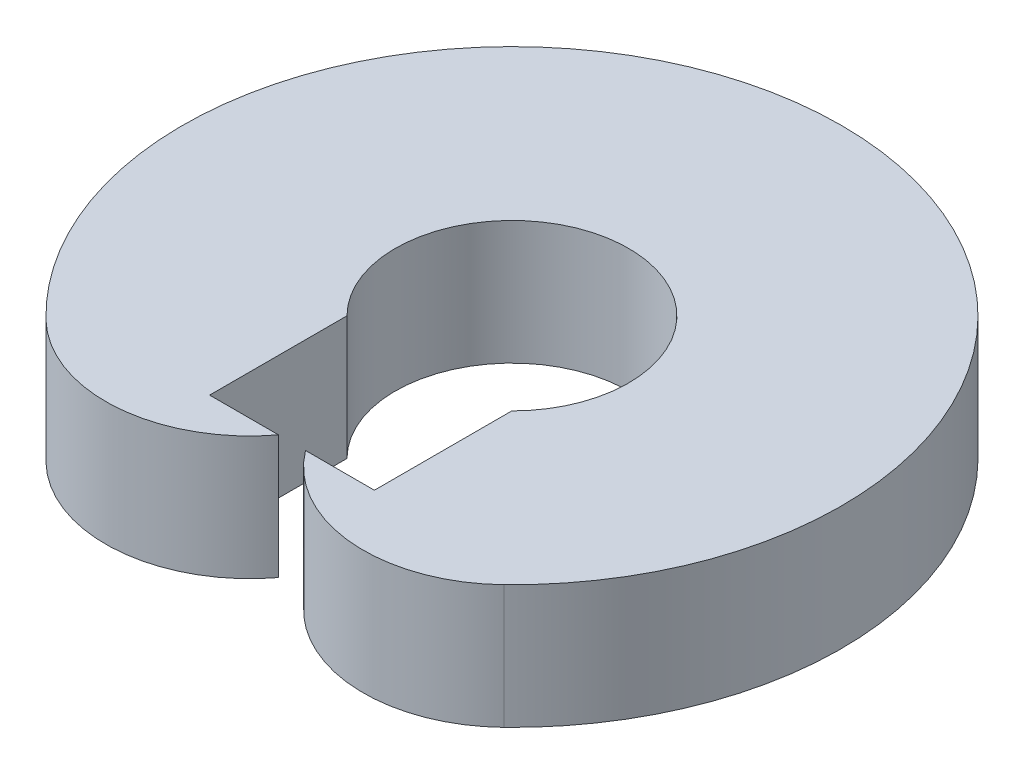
from build123d import *

# Parameters (mm, degrees)
EXTRUDE_1_DEPTH = 150


with BuildPart() as part:
    # Sketch 1 → Extrude 1 (new body)
    with BuildSketch(Plane(origin=(0, 0, 0), x_dir=(1, 0, 0), z_dir=(0, 1, 0))):
        with BuildLine():
            Line((-100, -267), (-100, -100.248468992))
            ThreePointArc((-100, -100.248468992), (0, 141.597159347), (100, -100.248468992))
            Line((100, -100.248468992), (100, -267))
            Line((100, -267), (16.409665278, -267))
            ThreePointArc((16.409665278, -267), (142.462310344, -336.303654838), (277.863348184, -287.735920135))
            ThreePointArc((277.863348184, -287.735920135), (0, 400), (-277.863348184, -287.735920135))
            ThreePointArc((-277.863348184, -287.735920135), (-142.462310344, -336.303654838), (-16.409665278, -267))
            Line((-16.409665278, -267), (-100, -267))
        make_face()
    extrude(amount=EXTRUDE_1_DEPTH)


solid = part.part
